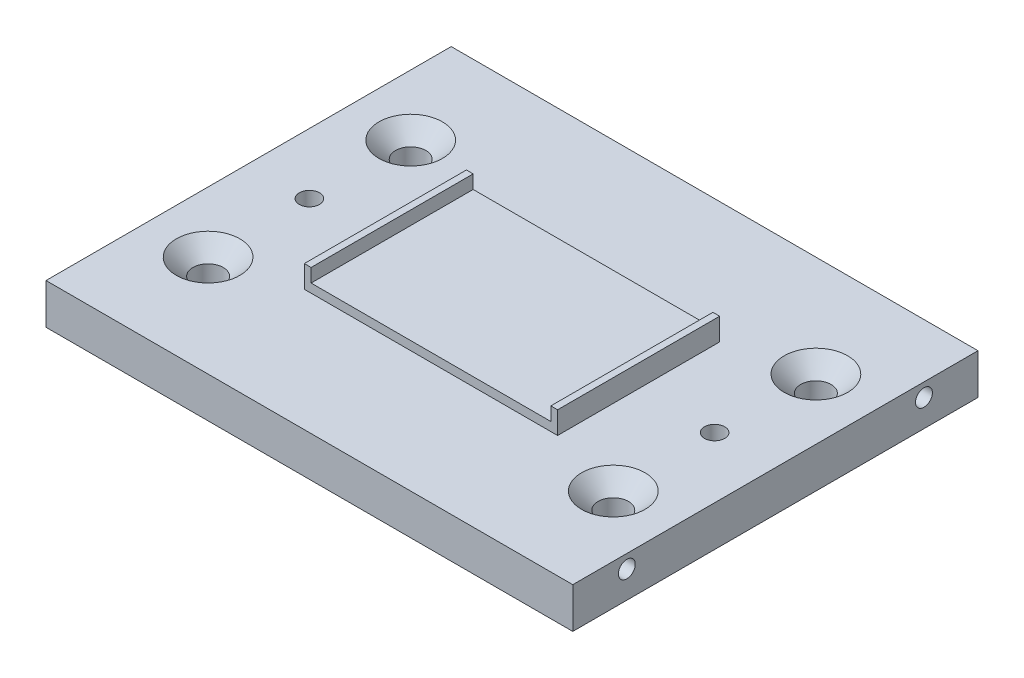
ISO-10303-21;
HEADER;
FILE_DESCRIPTION(('STEP AP214'),'2;1');
FILE_NAME('part.step','',(''),(''),'','','');
FILE_SCHEMA(('AUTOMOTIVE_DESIGN { 1 0 10303 214 1 1 1 1 }'));
ENDSEC;
DATA;
#1=APPLICATION_CONTEXT('core data for automotive mechanical design processes');
#2=APPLICATION_PROTOCOL_DEFINITION('international standard','automotive_design',2000,#1);
#3=PRODUCT_CONTEXT('',#1,'mechanical');
#4=PRODUCT('Part','Part','',(#3));
#5=PRODUCT_RELATED_PRODUCT_CATEGORY('part','',(#4));
#6=PRODUCT_DEFINITION_FORMATION('','',#4);
#7=PRODUCT_DEFINITION_CONTEXT('part definition',#1,'design');
#8=PRODUCT_DEFINITION('design','',#6,#7);
#9=PRODUCT_DEFINITION_SHAPE('','',#8);
#10=(LENGTH_UNIT() NAMED_UNIT(*) SI_UNIT(.MILLI.,.METRE.));
#11=(NAMED_UNIT(*) PLANE_ANGLE_UNIT() SI_UNIT($,.RADIAN.));
#12=(NAMED_UNIT(*) SI_UNIT($,.STERADIAN.) SOLID_ANGLE_UNIT());
#13=UNCERTAINTY_MEASURE_WITH_UNIT(LENGTH_MEASURE(1.E-05),#10,'distance_accuracy_value','');
#14=(GEOMETRIC_REPRESENTATION_CONTEXT(3) GLOBAL_UNCERTAINTY_ASSIGNED_CONTEXT((#13)) GLOBAL_UNIT_ASSIGNED_CONTEXT((#10,
#11,#12)) REPRESENTATION_CONTEXT('',''));
#15=CARTESIAN_POINT('',(0.,0.,0.));
#16=DIRECTION('',(0.,0.,1.));
#17=DIRECTION('',(1.,0.,0.));
#18=AXIS2_PLACEMENT_3D('',#15,#16,#17);
#19=CARTESIAN_POINT('',(0.,4.3,0.));
#20=DIRECTION('',(0.,-1.,0.));
#21=DIRECTION('',(0.,0.,-1.));
#22=AXIS2_PLACEMENT_3D('',#19,#20,#21);
#23=PLANE('',#22);
#24=DIRECTION('',(0.,0.,1.));
#25=VECTOR('',#24,1.);
#26=CARTESIAN_POINT('',(17.75,4.3,12.));
#27=LINE('',#26,#25);
#28=CARTESIAN_POINT('',(17.75,4.3,-12.));
#29=VERTEX_POINT('',#28);
#30=CARTESIAN_POINT('',(17.75,4.3,12.));
#31=VERTEX_POINT('',#30);
#32=EDGE_CURVE('E54',#29,#31,#27,.T.);
#33=ORIENTED_EDGE('',*,*,#32,.F.);
#34=DIRECTION('',(-1.,0.,0.));
#35=VECTOR('',#34,1.);
#36=CARTESIAN_POINT('',(-18.75,4.3,-12.));
#37=LINE('',#36,#35);
#38=CARTESIAN_POINT('',(-17.75,4.3,-12.));
#39=VERTEX_POINT('',#38);
#40=EDGE_CURVE('E40',#29,#39,#37,.T.);
#41=ORIENTED_EDGE('',*,*,#40,.T.);
#42=DIRECTION('',(0.,0.,-1.));
#43=VECTOR('',#42,1.);
#44=CARTESIAN_POINT('',(-17.75,4.3,12.));
#45=LINE('',#44,#43);
#46=CARTESIAN_POINT('',(-17.75,4.3,12.));
#47=VERTEX_POINT('',#46);
#48=EDGE_CURVE('E234',#47,#39,#45,.T.);
#49=ORIENTED_EDGE('',*,*,#48,.F.);
#50=DIRECTION('',(1.,0.,0.));
#51=VECTOR('',#50,1.);
#52=CARTESIAN_POINT('',(-18.75,4.3,12.));
#53=LINE('',#52,#51);
#54=EDGE_CURVE('E59',#47,#31,#53,.T.);
#55=ORIENTED_EDGE('',*,*,#54,.T.);
#56=EDGE_LOOP('',(#33,#41,#49,#55));
#57=FACE_BOUND('',#56,.T.);
#58=ADVANCED_FACE('F36',(#57),#23,.F.);
#59=CARTESIAN_POINT('',(39.,3.,30.));
#60=DIRECTION('',(0.,-1.,0.));
#61=DIRECTION('',(0.,0.,-1.));
#62=AXIS2_PLACEMENT_3D('',#59,#60,#61);
#63=PLANE('',#62);
#64=CARTESIAN_POINT('',(-30.,3.,0.));
#65=DIRECTION('',(0.,1.,0.));
#66=DIRECTION('',(0.,0.,1.));
#67=AXIS2_PLACEMENT_3D('',#64,#65,#66);
#68=CIRCLE('',#67,1.49999999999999);
#69=CARTESIAN_POINT('',(-30.,3.,1.49999999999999));
#70=VERTEX_POINT('',#69);
#71=EDGE_CURVE('E169',#70,#70,#68,.T.);
#72=ORIENTED_EDGE('',*,*,#71,.F.);
#73=EDGE_LOOP('',(#72));
#74=FACE_BOUND('',#73,.T.);
#75=CARTESIAN_POINT('',(30.,3.,0.));
#76=DIRECTION('',(0.,1.,0.));
#77=DIRECTION('',(0.,0.,1.));
#78=AXIS2_PLACEMENT_3D('',#75,#76,#77);
#79=CIRCLE('',#78,1.49999999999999);
#80=CARTESIAN_POINT('',(30.,3.,1.49999999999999));
#81=VERTEX_POINT('',#80);
#82=EDGE_CURVE('E175',#81,#81,#79,.T.);
#83=ORIENTED_EDGE('',*,*,#82,.F.);
#84=EDGE_LOOP('',(#83));
#85=FACE_BOUND('',#84,.T.);
#86=CARTESIAN_POINT('',(-30.,3.,-15.));
#87=DIRECTION('',(0.,1.,0.));
#88=DIRECTION('',(0.,0.,1.));
#89=AXIS2_PLACEMENT_3D('',#86,#87,#88);
#90=CIRCLE('',#89,4.7);
#91=CARTESIAN_POINT('',(-30.,3.,-10.3));
#92=VERTEX_POINT('',#91);
#93=EDGE_CURVE('E181',#92,#92,#90,.T.);
#94=ORIENTED_EDGE('',*,*,#93,.F.);
#95=EDGE_LOOP('',(#94));
#96=FACE_BOUND('',#95,.T.);
#97=CARTESIAN_POINT('',(30.,3.,-15.));
#98=DIRECTION('',(0.,1.,0.));
#99=DIRECTION('',(0.,0.,1.));
#100=AXIS2_PLACEMENT_3D('',#97,#98,#99);
#101=CIRCLE('',#100,4.7);
#102=CARTESIAN_POINT('',(30.,3.,-10.3));
#103=VERTEX_POINT('',#102);
#104=EDGE_CURVE('E190',#103,#103,#101,.T.);
#105=ORIENTED_EDGE('',*,*,#104,.F.);
#106=EDGE_LOOP('',(#105));
#107=FACE_BOUND('',#106,.T.);
#108=CARTESIAN_POINT('',(30.,3.,15.));
#109=DIRECTION('',(0.,1.,0.));
#110=DIRECTION('',(0.,0.,1.));
#111=AXIS2_PLACEMENT_3D('',#108,#109,#110);
#112=CIRCLE('',#111,4.7);
#113=CARTESIAN_POINT('',(30.,3.,19.7));
#114=VERTEX_POINT('',#113);
#115=EDGE_CURVE('E199',#114,#114,#112,.T.);
#116=ORIENTED_EDGE('',*,*,#115,.F.);
#117=EDGE_LOOP('',(#116));
#118=FACE_BOUND('',#117,.T.);
#119=CARTESIAN_POINT('',(-30.,3.,15.));
#120=DIRECTION('',(0.,1.,0.));
#121=DIRECTION('',(0.,0.,1.));
#122=AXIS2_PLACEMENT_3D('',#119,#120,#121);
#123=CIRCLE('',#122,4.7);
#124=CARTESIAN_POINT('',(-30.,3.,19.7));
#125=VERTEX_POINT('',#124);
#126=EDGE_CURVE('E208',#125,#125,#123,.T.);
#127=ORIENTED_EDGE('',*,*,#126,.F.);
#128=EDGE_LOOP('',(#127));
#129=FACE_BOUND('',#128,.T.);
#130=DIRECTION('',(0.,0.,1.));
#131=VECTOR('',#130,1.);
#132=CARTESIAN_POINT('',(-39.,3.,30.));
#133=LINE('',#132,#131);
#134=CARTESIAN_POINT('',(-39.,3.,-30.));
#135=VERTEX_POINT('',#134);
#136=CARTESIAN_POINT('',(-39.,3.,30.));
#137=VERTEX_POINT('',#136);
#138=EDGE_CURVE('E304',#135,#137,#133,.T.);
#139=ORIENTED_EDGE('',*,*,#138,.T.);
#140=DIRECTION('',(-1.,0.,0.));
#141=VECTOR('',#140,1.);
#142=CARTESIAN_POINT('',(39.,3.,30.));
#143=LINE('',#142,#141);
#144=CARTESIAN_POINT('',(39.,3.,30.));
#145=VERTEX_POINT('',#144);
#146=EDGE_CURVE('E46',#145,#137,#143,.T.);
#147=ORIENTED_EDGE('',*,*,#146,.F.);
#148=DIRECTION('',(0.,0.,1.));
#149=VECTOR('',#148,1.);
#150=CARTESIAN_POINT('',(39.,3.,30.));
#151=LINE('',#150,#149);
#152=CARTESIAN_POINT('',(39.,3.,-30.));
#153=VERTEX_POINT('',#152);
#154=EDGE_CURVE('E294',#153,#145,#151,.T.);
#155=ORIENTED_EDGE('',*,*,#154,.F.);
#156=DIRECTION('',(-1.,0.,0.));
#157=VECTOR('',#156,1.);
#158=CARTESIAN_POINT('',(39.,3.,-30.));
#159=LINE('',#158,#157);
#160=EDGE_CURVE('E11',#153,#135,#159,.T.);
#161=ORIENTED_EDGE('',*,*,#160,.T.);
#162=EDGE_LOOP('',(#139,#147,#155,#161));
#163=FACE_BOUND('',#162,.T.);
#164=DIRECTION('',(0.,0.,-1.));
#165=VECTOR('',#164,1.);
#166=CARTESIAN_POINT('',(18.75,3.,12.));
#167=LINE('',#166,#165);
#168=CARTESIAN_POINT('',(18.75,3.,12.));
#169=VERTEX_POINT('',#168);
#170=CARTESIAN_POINT('',(18.75,3.,-12.));
#171=VERTEX_POINT('',#170);
#172=EDGE_CURVE('E259',#169,#171,#167,.T.);
#173=ORIENTED_EDGE('',*,*,#172,.F.);
#174=DIRECTION('',(1.,0.,0.));
#175=VECTOR('',#174,1.);
#176=CARTESIAN_POINT('',(-18.75,3.,12.));
#177=LINE('',#176,#175);
#178=CARTESIAN_POINT('',(-18.75,3.,12.));
#179=VERTEX_POINT('',#178);
#180=EDGE_CURVE('E276',#179,#169,#177,.T.);
#181=ORIENTED_EDGE('',*,*,#180,.F.);
#182=DIRECTION('',(0.,0.,1.));
#183=VECTOR('',#182,1.);
#184=CARTESIAN_POINT('',(-18.75,3.,12.));
#185=LINE('',#184,#183);
#186=CARTESIAN_POINT('',(-18.75,3.,-12.));
#187=VERTEX_POINT('',#186);
#188=EDGE_CURVE('E270',#187,#179,#185,.T.);
#189=ORIENTED_EDGE('',*,*,#188,.F.);
#190=DIRECTION('',(-1.,0.,0.));
#191=VECTOR('',#190,1.);
#192=CARTESIAN_POINT('',(-18.75,3.,-12.));
#193=LINE('',#192,#191);
#194=EDGE_CURVE('E265',#171,#187,#193,.T.);
#195=ORIENTED_EDGE('',*,*,#194,.F.);
#196=EDGE_LOOP('',(#173,#181,#189,#195));
#197=FACE_BOUND('',#196,.T.);
#198=ADVANCED_FACE('F335',(#74,#85,#96,#107,#118,#129,#163,#197),#63,.F.);
#199=CARTESIAN_POINT('',(39.,-3.,-30.));
#200=DIRECTION('',(0.,0.,1.));
#201=DIRECTION('',(1.,0.,0.));
#202=AXIS2_PLACEMENT_3D('',#199,#200,#201);
#203=PLANE('',#202);
#204=DIRECTION('',(0.,1.,0.));
#205=VECTOR('',#204,1.);
#206=CARTESIAN_POINT('',(-39.,-3.,-30.));
#207=LINE('',#206,#205);
#208=CARTESIAN_POINT('',(-39.,-3.,-30.));
#209=VERTEX_POINT('',#208);
#210=EDGE_CURVE('E290',#209,#135,#207,.T.);
#211=ORIENTED_EDGE('',*,*,#210,.T.);
#212=ORIENTED_EDGE('',*,*,#160,.F.);
#213=DIRECTION('',(0.,1.,0.));
#214=VECTOR('',#213,1.);
#215=CARTESIAN_POINT('',(39.,-3.,-30.));
#216=LINE('',#215,#214);
#217=CARTESIAN_POINT('',(39.,-3.,-30.));
#218=VERTEX_POINT('',#217);
#219=EDGE_CURVE('E291',#218,#153,#216,.T.);
#220=ORIENTED_EDGE('',*,*,#219,.F.);
#221=DIRECTION('',(-1.,0.,0.));
#222=VECTOR('',#221,1.);
#223=CARTESIAN_POINT('',(39.,-3.,-30.));
#224=LINE('',#223,#222);
#225=EDGE_CURVE('E301',#218,#209,#224,.T.);
#226=ORIENTED_EDGE('',*,*,#225,.T.);
#227=EDGE_LOOP('',(#211,#212,#220,#226));
#228=FACE_BOUND('',#227,.T.);
#229=ADVANCED_FACE('F38',(#228),#203,.F.);
#230=CARTESIAN_POINT('',(39.,-3.,30.));
#231=DIRECTION('',(0.,0.,-1.));
#232=DIRECTION('',(-1.,0.,0.));
#233=AXIS2_PLACEMENT_3D('',#230,#231,#232);
#234=PLANE('',#233);
#235=DIRECTION('',(0.,-1.,0.));
#236=VECTOR('',#235,1.);
#237=CARTESIAN_POINT('',(-39.,-3.,30.));
#238=LINE('',#237,#236);
#239=CARTESIAN_POINT('',(-39.,-3.,30.));
#240=VERTEX_POINT('',#239);
#241=EDGE_CURVE('E306',#137,#240,#238,.T.);
#242=ORIENTED_EDGE('',*,*,#241,.T.);
#243=DIRECTION('',(-1.,0.,0.));
#244=VECTOR('',#243,1.);
#245=CARTESIAN_POINT('',(39.,-3.,30.));
#246=LINE('',#245,#244);
#247=CARTESIAN_POINT('',(39.,-3.,30.));
#248=VERTEX_POINT('',#247);
#249=EDGE_CURVE('E311',#248,#240,#246,.T.);
#250=ORIENTED_EDGE('',*,*,#249,.F.);
#251=DIRECTION('',(0.,-1.,0.));
#252=VECTOR('',#251,1.);
#253=CARTESIAN_POINT('',(39.,-3.,30.));
#254=LINE('',#253,#252);
#255=EDGE_CURVE('E297',#145,#248,#254,.T.);
#256=ORIENTED_EDGE('',*,*,#255,.F.);
#257=ORIENTED_EDGE('',*,*,#146,.T.);
#258=EDGE_LOOP('',(#242,#250,#256,#257));
#259=FACE_BOUND('',#258,.T.);
#260=ADVANCED_FACE('F319',(#259),#234,.F.);
#261=CARTESIAN_POINT('',(39.,-3.,30.));
#262=DIRECTION('',(0.,1.,0.));
#263=DIRECTION('',(0.,0.,1.));
#264=AXIS2_PLACEMENT_3D('',#261,#262,#263);
#265=PLANE('',#264);
#266=CARTESIAN_POINT('',(-30.,-3.,0.));
#267=DIRECTION('',(0.,1.,0.));
#268=DIRECTION('',(0.,0.,1.));
#269=AXIS2_PLACEMENT_3D('',#266,#267,#268);
#270=CIRCLE('',#269,1.5);
#271=CARTESIAN_POINT('',(-30.,-3.,1.5));
#272=VERTEX_POINT('',#271);
#273=EDGE_CURVE('E172',#272,#272,#270,.T.);
#274=ORIENTED_EDGE('',*,*,#273,.T.);
#275=EDGE_LOOP('',(#274));
#276=FACE_BOUND('',#275,.T.);
#277=CARTESIAN_POINT('',(30.,-3.,0.));
#278=DIRECTION('',(0.,1.,0.));
#279=DIRECTION('',(0.,0.,1.));
#280=AXIS2_PLACEMENT_3D('',#277,#278,#279);
#281=CIRCLE('',#280,1.5);
#282=CARTESIAN_POINT('',(30.,-3.,1.5));
#283=VERTEX_POINT('',#282);
#284=EDGE_CURVE('E178',#283,#283,#281,.T.);
#285=ORIENTED_EDGE('',*,*,#284,.T.);
#286=EDGE_LOOP('',(#285));
#287=FACE_BOUND('',#286,.T.);
#288=CARTESIAN_POINT('',(-30.,-3.,-15.));
#289=DIRECTION('',(0.,1.,0.));
#290=DIRECTION('',(0.,0.,1.));
#291=AXIS2_PLACEMENT_3D('',#288,#289,#290);
#292=CIRCLE('',#291,2.25);
#293=CARTESIAN_POINT('',(-30.,-3.,-12.75));
#294=VERTEX_POINT('',#293);
#295=EDGE_CURVE('E187',#294,#294,#292,.T.);
#296=ORIENTED_EDGE('',*,*,#295,.T.);
#297=EDGE_LOOP('',(#296));
#298=FACE_BOUND('',#297,.T.);
#299=CARTESIAN_POINT('',(30.,-3.,-15.));
#300=DIRECTION('',(0.,1.,0.));
#301=DIRECTION('',(0.,0.,1.));
#302=AXIS2_PLACEMENT_3D('',#299,#300,#301);
#303=CIRCLE('',#302,2.25);
#304=CARTESIAN_POINT('',(30.,-3.,-12.75));
#305=VERTEX_POINT('',#304);
#306=EDGE_CURVE('E196',#305,#305,#303,.T.);
#307=ORIENTED_EDGE('',*,*,#306,.T.);
#308=EDGE_LOOP('',(#307));
#309=FACE_BOUND('',#308,.T.);
#310=CARTESIAN_POINT('',(30.,-3.,15.));
#311=DIRECTION('',(0.,1.,0.));
#312=DIRECTION('',(0.,0.,1.));
#313=AXIS2_PLACEMENT_3D('',#310,#311,#312);
#314=CIRCLE('',#313,2.25);
#315=CARTESIAN_POINT('',(30.,-3.,17.25));
#316=VERTEX_POINT('',#315);
#317=EDGE_CURVE('E205',#316,#316,#314,.T.);
#318=ORIENTED_EDGE('',*,*,#317,.T.);
#319=EDGE_LOOP('',(#318));
#320=FACE_BOUND('',#319,.T.);
#321=CARTESIAN_POINT('',(-30.,-3.,15.));
#322=DIRECTION('',(0.,1.,0.));
#323=DIRECTION('',(0.,0.,1.));
#324=AXIS2_PLACEMENT_3D('',#321,#322,#323);
#325=CIRCLE('',#324,2.25);
#326=CARTESIAN_POINT('',(-30.,-3.,17.25));
#327=VERTEX_POINT('',#326);
#328=EDGE_CURVE('E214',#327,#327,#325,.T.);
#329=ORIENTED_EDGE('',*,*,#328,.T.);
#330=EDGE_LOOP('',(#329));
#331=FACE_BOUND('',#330,.T.);
#332=DIRECTION('',(0.,0.,-1.));
#333=VECTOR('',#332,1.);
#334=CARTESIAN_POINT('',(-39.,-3.,30.));
#335=LINE('',#334,#333);
#336=EDGE_CURVE('E295',#240,#209,#335,.T.);
#337=ORIENTED_EDGE('',*,*,#336,.T.);
#338=ORIENTED_EDGE('',*,*,#225,.F.);
#339=DIRECTION('',(0.,0.,-1.));
#340=VECTOR('',#339,1.);
#341=CARTESIAN_POINT('',(39.,-3.,30.));
#342=LINE('',#341,#340);
#343=EDGE_CURVE('E299',#248,#218,#342,.T.);
#344=ORIENTED_EDGE('',*,*,#343,.F.);
#345=ORIENTED_EDGE('',*,*,#249,.T.);
#346=EDGE_LOOP('',(#337,#338,#344,#345));
#347=FACE_BOUND('',#346,.T.);
#348=ADVANCED_FACE('F328',(#276,#287,#298,#309,#320,#331,#347),#265,.F.);
#349=CARTESIAN_POINT('',(39.,0.,0.));
#350=DIRECTION('',(-1.,0.,0.));
#351=DIRECTION('',(0.,0.,1.));
#352=AXIS2_PLACEMENT_3D('',#349,#350,#351);
#353=PLANE('',#352);
#354=CARTESIAN_POINT('',(39.,1.,-22.));
#355=DIRECTION('',(1.,0.,0.));
#356=DIRECTION('',(0.,0.,-1.));
#357=AXIS2_PLACEMENT_3D('',#354,#355,#356);
#358=CIRCLE('',#357,1.24999999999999);
#359=CARTESIAN_POINT('',(39.,1.,-23.25));
#360=VERTEX_POINT('',#359);
#361=EDGE_CURVE('E147',#360,#360,#358,.T.);
#362=ORIENTED_EDGE('',*,*,#361,.F.);
#363=EDGE_LOOP('',(#362));
#364=FACE_BOUND('',#363,.T.);
#365=CARTESIAN_POINT('',(39.,1.,22.));
#366=DIRECTION('',(1.,0.,0.));
#367=DIRECTION('',(0.,0.,-1.));
#368=AXIS2_PLACEMENT_3D('',#365,#366,#367);
#369=CIRCLE('',#368,1.24999999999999);
#370=CARTESIAN_POINT('',(39.,1.,20.75));
#371=VERTEX_POINT('',#370);
#372=EDGE_CURVE('E146',#371,#371,#369,.T.);
#373=ORIENTED_EDGE('',*,*,#372,.F.);
#374=EDGE_LOOP('',(#373));
#375=FACE_BOUND('',#374,.T.);
#376=ORIENTED_EDGE('',*,*,#219,.T.);
#377=ORIENTED_EDGE('',*,*,#154,.T.);
#378=ORIENTED_EDGE('',*,*,#255,.T.);
#379=ORIENTED_EDGE('',*,*,#343,.T.);
#380=EDGE_LOOP('',(#376,#377,#378,#379));
#381=FACE_BOUND('',#380,.T.);
#382=ADVANCED_FACE('F334',(#364,#375,#381),#353,.F.);
#383=CARTESIAN_POINT('',(-39.,0.,0.));
#384=DIRECTION('',(-1.,0.,0.));
#385=DIRECTION('',(0.,0.,1.));
#386=AXIS2_PLACEMENT_3D('',#383,#384,#385);
#387=PLANE('',#386);
#388=CARTESIAN_POINT('',(-39.,1.,-22.));
#389=DIRECTION('',(-1.,0.,0.));
#390=DIRECTION('',(0.,0.,1.));
#391=AXIS2_PLACEMENT_3D('',#388,#389,#390);
#392=CIRCLE('',#391,1.24999999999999);
#393=CARTESIAN_POINT('',(-39.,1.,-20.75));
#394=VERTEX_POINT('',#393);
#395=EDGE_CURVE('E157',#394,#394,#392,.T.);
#396=ORIENTED_EDGE('',*,*,#395,.F.);
#397=EDGE_LOOP('',(#396));
#398=FACE_BOUND('',#397,.T.);
#399=CARTESIAN_POINT('',(-39.,1.,22.));
#400=DIRECTION('',(-1.,0.,0.));
#401=DIRECTION('',(0.,0.,1.));
#402=AXIS2_PLACEMENT_3D('',#399,#400,#401);
#403=CIRCLE('',#402,1.24999999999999);
#404=CARTESIAN_POINT('',(-39.,1.,23.25));
#405=VERTEX_POINT('',#404);
#406=EDGE_CURVE('E163',#405,#405,#403,.T.);
#407=ORIENTED_EDGE('',*,*,#406,.F.);
#408=EDGE_LOOP('',(#407));
#409=FACE_BOUND('',#408,.T.);
#410=ORIENTED_EDGE('',*,*,#210,.F.);
#411=ORIENTED_EDGE('',*,*,#336,.F.);
#412=ORIENTED_EDGE('',*,*,#241,.F.);
#413=ORIENTED_EDGE('',*,*,#138,.F.);
#414=EDGE_LOOP('',(#410,#411,#412,#413));
#415=FACE_BOUND('',#414,.T.);
#416=ADVANCED_FACE('F325',(#398,#409,#415),#387,.T.);
#417=CARTESIAN_POINT('',(18.75,4.3,12.));
#418=DIRECTION('',(-1.,0.,0.));
#419=DIRECTION('',(0.,0.,1.));
#420=AXIS2_PLACEMENT_3D('',#417,#418,#419);
#421=PLANE('',#420);
#422=ORIENTED_EDGE('',*,*,#172,.T.);
#423=DIRECTION('',(0.,-1.,0.));
#424=VECTOR('',#423,1.);
#425=CARTESIAN_POINT('',(18.75,4.3,-12.));
#426=LINE('',#425,#424);
#427=CARTESIAN_POINT('',(18.75,6.3,-12.));
#428=VERTEX_POINT('',#427);
#429=EDGE_CURVE('E287',#428,#171,#426,.T.);
#430=ORIENTED_EDGE('',*,*,#429,.F.);
#431=DIRECTION('',(0.,0.,-1.));
#432=VECTOR('',#431,1.);
#433=CARTESIAN_POINT('',(18.75,6.3,12.));
#434=LINE('',#433,#432);
#435=CARTESIAN_POINT('',(18.75,6.3,12.));
#436=VERTEX_POINT('',#435);
#437=EDGE_CURVE('E217',#436,#428,#434,.T.);
#438=ORIENTED_EDGE('',*,*,#437,.F.);
#439=DIRECTION('',(0.,-1.,0.));
#440=VECTOR('',#439,1.);
#441=CARTESIAN_POINT('',(18.75,4.3,12.));
#442=LINE('',#441,#440);
#443=EDGE_CURVE('E279',#436,#169,#442,.T.);
#444=ORIENTED_EDGE('',*,*,#443,.T.);
#445=EDGE_LOOP('',(#422,#430,#438,#444));
#446=FACE_BOUND('',#445,.T.);
#447=ADVANCED_FACE('F344',(#446),#421,.F.);
#448=CARTESIAN_POINT('',(-18.75,4.3,-12.));
#449=DIRECTION('',(0.,0.,1.));
#450=DIRECTION('',(1.,0.,0.));
#451=AXIS2_PLACEMENT_3D('',#448,#449,#450);
#452=PLANE('',#451);
#453=ORIENTED_EDGE('',*,*,#194,.T.);
#454=DIRECTION('',(0.,-1.,0.));
#455=VECTOR('',#454,1.);
#456=CARTESIAN_POINT('',(-18.75,4.3,-12.));
#457=LINE('',#456,#455);
#458=CARTESIAN_POINT('',(-18.75,6.3,-12.));
#459=VERTEX_POINT('',#458);
#460=EDGE_CURVE('E284',#459,#187,#457,.T.);
#461=ORIENTED_EDGE('',*,*,#460,.F.);
#462=DIRECTION('',(-1.,0.,0.));
#463=VECTOR('',#462,1.);
#464=CARTESIAN_POINT('',(-18.75,6.3,-12.));
#465=LINE('',#464,#463);
#466=CARTESIAN_POINT('',(-17.75,6.3,-12.));
#467=VERTEX_POINT('',#466);
#468=EDGE_CURVE('E242',#467,#459,#465,.T.);
#469=ORIENTED_EDGE('',*,*,#468,.F.);
#470=DIRECTION('',(0.,-1.,0.));
#471=VECTOR('',#470,1.);
#472=CARTESIAN_POINT('',(-17.75,6.3,-12.));
#473=LINE('',#472,#471);
#474=EDGE_CURVE('E245',#467,#39,#473,.T.);
#475=ORIENTED_EDGE('',*,*,#474,.T.);
#476=ORIENTED_EDGE('',*,*,#40,.F.);
#477=DIRECTION('',(0.,-1.,0.));
#478=VECTOR('',#477,1.);
#479=CARTESIAN_POINT('',(17.75,6.3,-12.));
#480=LINE('',#479,#478);
#481=CARTESIAN_POINT('',(17.75,6.3,-12.));
#482=VERTEX_POINT('',#481);
#483=EDGE_CURVE('E231',#482,#29,#480,.T.);
#484=ORIENTED_EDGE('',*,*,#483,.F.);
#485=DIRECTION('',(-1.,0.,0.));
#486=VECTOR('',#485,1.);
#487=CARTESIAN_POINT('',(18.75,6.3,-12.));
#488=LINE('',#487,#486);
#489=EDGE_CURVE('E220',#428,#482,#488,.T.);
#490=ORIENTED_EDGE('',*,*,#489,.F.);
#491=ORIENTED_EDGE('',*,*,#429,.T.);
#492=EDGE_LOOP('',(#453,#461,#469,#475,#476,#484,#490,#491));
#493=FACE_BOUND('',#492,.T.);
#494=ADVANCED_FACE('F354',(#493),#452,.F.);
#495=CARTESIAN_POINT('',(-18.75,4.3,12.));
#496=DIRECTION('',(1.,0.,0.));
#497=DIRECTION('',(0.,0.,-1.));
#498=AXIS2_PLACEMENT_3D('',#495,#496,#497);
#499=PLANE('',#498);
#500=ORIENTED_EDGE('',*,*,#188,.T.);
#501=DIRECTION('',(0.,-1.,0.));
#502=VECTOR('',#501,1.);
#503=CARTESIAN_POINT('',(-18.75,4.3,12.));
#504=LINE('',#503,#502);
#505=CARTESIAN_POINT('',(-18.75,6.3,12.));
#506=VERTEX_POINT('',#505);
#507=EDGE_CURVE('E281',#506,#179,#504,.T.);
#508=ORIENTED_EDGE('',*,*,#507,.F.);
#509=DIRECTION('',(0.,0.,1.));
#510=VECTOR('',#509,1.);
#511=CARTESIAN_POINT('',(-18.75,6.3,12.));
#512=LINE('',#511,#510);
#513=EDGE_CURVE('E235',#459,#506,#512,.T.);
#514=ORIENTED_EDGE('',*,*,#513,.F.);
#515=ORIENTED_EDGE('',*,*,#460,.T.);
#516=EDGE_LOOP('',(#500,#508,#514,#515));
#517=FACE_BOUND('',#516,.T.);
#518=ADVANCED_FACE('F362',(#517),#499,.F.);
#519=CARTESIAN_POINT('',(-18.75,4.3,12.));
#520=DIRECTION('',(0.,0.,-1.));
#521=DIRECTION('',(-1.,0.,0.));
#522=AXIS2_PLACEMENT_3D('',#519,#520,#521);
#523=PLANE('',#522);
#524=ORIENTED_EDGE('',*,*,#180,.T.);
#525=ORIENTED_EDGE('',*,*,#443,.F.);
#526=DIRECTION('',(1.,0.,0.));
#527=VECTOR('',#526,1.);
#528=CARTESIAN_POINT('',(18.75,6.3,12.));
#529=LINE('',#528,#527);
#530=CARTESIAN_POINT('',(17.75,6.3,12.));
#531=VERTEX_POINT('',#530);
#532=EDGE_CURVE('E224',#531,#436,#529,.T.);
#533=ORIENTED_EDGE('',*,*,#532,.F.);
#534=DIRECTION('',(0.,-1.,0.));
#535=VECTOR('',#534,1.);
#536=CARTESIAN_POINT('',(17.75,6.3,12.));
#537=LINE('',#536,#535);
#538=EDGE_CURVE('E227',#531,#31,#537,.T.);
#539=ORIENTED_EDGE('',*,*,#538,.T.);
#540=ORIENTED_EDGE('',*,*,#54,.F.);
#541=DIRECTION('',(0.,-1.,0.));
#542=VECTOR('',#541,1.);
#543=CARTESIAN_POINT('',(-17.75,6.3,12.));
#544=LINE('',#543,#542);
#545=CARTESIAN_POINT('',(-17.75,6.3,12.));
#546=VERTEX_POINT('',#545);
#547=EDGE_CURVE('E255',#546,#47,#544,.T.);
#548=ORIENTED_EDGE('',*,*,#547,.F.);
#549=DIRECTION('',(1.,0.,0.));
#550=VECTOR('',#549,1.);
#551=CARTESIAN_POINT('',(-18.75,6.3,12.));
#552=LINE('',#551,#550);
#553=EDGE_CURVE('E238',#506,#546,#552,.T.);
#554=ORIENTED_EDGE('',*,*,#553,.F.);
#555=ORIENTED_EDGE('',*,*,#507,.T.);
#556=EDGE_LOOP('',(#524,#525,#533,#539,#540,#548,#554,#555));
#557=FACE_BOUND('',#556,.T.);
#558=ADVANCED_FACE('F340',(#557),#523,.F.);
#559=CARTESIAN_POINT('',(-17.75,6.3,12.));
#560=DIRECTION('',(-1.,0.,0.));
#561=DIRECTION('',(0.,0.,1.));
#562=AXIS2_PLACEMENT_3D('',#559,#560,#561);
#563=PLANE('',#562);
#564=ORIENTED_EDGE('',*,*,#48,.T.);
#565=ORIENTED_EDGE('',*,*,#474,.F.);
#566=DIRECTION('',(0.,0.,-1.));
#567=VECTOR('',#566,1.);
#568=CARTESIAN_POINT('',(-17.75,6.3,12.));
#569=LINE('',#568,#567);
#570=EDGE_CURVE('E240',#546,#467,#569,.T.);
#571=ORIENTED_EDGE('',*,*,#570,.F.);
#572=ORIENTED_EDGE('',*,*,#547,.T.);
#573=EDGE_LOOP('',(#564,#565,#571,#572));
#574=FACE_BOUND('',#573,.T.);
#575=ADVANCED_FACE('F357',(#574),#563,.F.);
#576=CARTESIAN_POINT('',(0.,6.3,0.));
#577=DIRECTION('',(0.,-1.,0.));
#578=DIRECTION('',(0.,0.,-1.));
#579=AXIS2_PLACEMENT_3D('',#576,#577,#578);
#580=PLANE('',#579);
#581=ORIENTED_EDGE('',*,*,#513,.T.);
#582=ORIENTED_EDGE('',*,*,#553,.T.);
#583=ORIENTED_EDGE('',*,*,#570,.T.);
#584=ORIENTED_EDGE('',*,*,#468,.T.);
#585=EDGE_LOOP('',(#581,#582,#583,#584));
#586=FACE_BOUND('',#585,.T.);
#587=ADVANCED_FACE('F360',(#586),#580,.F.);
#588=CARTESIAN_POINT('',(17.75,6.3,12.));
#589=DIRECTION('',(1.,0.,0.));
#590=DIRECTION('',(0.,0.,-1.));
#591=AXIS2_PLACEMENT_3D('',#588,#589,#590);
#592=PLANE('',#591);
#593=ORIENTED_EDGE('',*,*,#32,.T.);
#594=ORIENTED_EDGE('',*,*,#538,.F.);
#595=DIRECTION('',(0.,0.,1.));
#596=VECTOR('',#595,1.);
#597=CARTESIAN_POINT('',(17.75,6.3,12.));
#598=LINE('',#597,#596);
#599=EDGE_CURVE('E222',#482,#531,#598,.T.);
#600=ORIENTED_EDGE('',*,*,#599,.F.);
#601=ORIENTED_EDGE('',*,*,#483,.T.);
#602=EDGE_LOOP('',(#593,#594,#600,#601));
#603=FACE_BOUND('',#602,.T.);
#604=ADVANCED_FACE('F352',(#603),#592,.F.);
#605=CARTESIAN_POINT('',(0.,6.3,0.));
#606=DIRECTION('',(0.,1.,0.));
#607=DIRECTION('',(0.,0.,1.));
#608=AXIS2_PLACEMENT_3D('',#605,#606,#607);
#609=PLANE('',#608);
#610=ORIENTED_EDGE('',*,*,#437,.T.);
#611=ORIENTED_EDGE('',*,*,#489,.T.);
#612=ORIENTED_EDGE('',*,*,#599,.T.);
#613=ORIENTED_EDGE('',*,*,#532,.T.);
#614=EDGE_LOOP('',(#610,#611,#612,#613));
#615=FACE_BOUND('',#614,.T.);
#616=ADVANCED_FACE('F347',(#615),#609,.T.);
#617=CARTESIAN_POINT('',(-30.,3.,15.));
#618=DIRECTION('',(0.,1.,0.));
#619=DIRECTION('',(0.,0.,1.));
#620=AXIS2_PLACEMENT_3D('',#617,#618,#619);
#621=CYLINDRICAL_SURFACE('',#620,2.25);
#622=ORIENTED_EDGE('',*,*,#328,.F.);
#623=EDGE_LOOP('',(#622));
#624=FACE_BOUND('',#623,.T.);
#625=CARTESIAN_POINT('',(-30.,0.55,15.));
#626=DIRECTION('',(0.,1.,0.));
#627=DIRECTION('',(0.,0.,1.));
#628=AXIS2_PLACEMENT_3D('',#625,#626,#627);
#629=CIRCLE('',#628,2.25);
#630=CARTESIAN_POINT('',(-30.,0.55,17.25));
#631=VERTEX_POINT('',#630);
#632=EDGE_CURVE('E211',#631,#631,#629,.T.);
#633=ORIENTED_EDGE('',*,*,#632,.T.);
#634=EDGE_LOOP('',(#633));
#635=FACE_BOUND('',#634,.T.);
#636=ADVANCED_FACE('F384',(#624,#635),#621,.F.);
#637=CARTESIAN_POINT('',(-30.,3.,15.));
#638=DIRECTION('',(0.,1.,0.));
#639=DIRECTION('',(0.,0.,1.));
#640=AXIS2_PLACEMENT_3D('',#637,#638,#639);
#641=CONICAL_SURFACE('',#640,4.7,0.785398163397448);
#642=ORIENTED_EDGE('',*,*,#632,.F.);
#643=EDGE_LOOP('',(#642));
#644=FACE_BOUND('',#643,.T.);
#645=ORIENTED_EDGE('',*,*,#126,.T.);
#646=EDGE_LOOP('',(#645));
#647=FACE_BOUND('',#646,.T.);
#648=ADVANCED_FACE('F387',(#644,#647),#641,.F.);
#649=CARTESIAN_POINT('',(30.,3.,15.));
#650=DIRECTION('',(0.,1.,0.));
#651=DIRECTION('',(0.,0.,1.));
#652=AXIS2_PLACEMENT_3D('',#649,#650,#651);
#653=CYLINDRICAL_SURFACE('',#652,2.25);
#654=ORIENTED_EDGE('',*,*,#317,.F.);
#655=EDGE_LOOP('',(#654));
#656=FACE_BOUND('',#655,.T.);
#657=CARTESIAN_POINT('',(30.,0.55,15.));
#658=DIRECTION('',(0.,1.,0.));
#659=DIRECTION('',(0.,0.,1.));
#660=AXIS2_PLACEMENT_3D('',#657,#658,#659);
#661=CIRCLE('',#660,2.25);
#662=CARTESIAN_POINT('',(30.,0.55,17.25));
#663=VERTEX_POINT('',#662);
#664=EDGE_CURVE('E202',#663,#663,#661,.T.);
#665=ORIENTED_EDGE('',*,*,#664,.T.);
#666=EDGE_LOOP('',(#665));
#667=FACE_BOUND('',#666,.T.);
#668=ADVANCED_FACE('F391',(#656,#667),#653,.F.);
#669=CARTESIAN_POINT('',(30.,3.,15.));
#670=DIRECTION('',(0.,1.,0.));
#671=DIRECTION('',(0.,0.,1.));
#672=AXIS2_PLACEMENT_3D('',#669,#670,#671);
#673=CONICAL_SURFACE('',#672,4.7,0.785398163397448);
#674=ORIENTED_EDGE('',*,*,#664,.F.);
#675=EDGE_LOOP('',(#674));
#676=FACE_BOUND('',#675,.T.);
#677=ORIENTED_EDGE('',*,*,#115,.T.);
#678=EDGE_LOOP('',(#677));
#679=FACE_BOUND('',#678,.T.);
#680=ADVANCED_FACE('F395',(#676,#679),#673,.F.);
#681=CARTESIAN_POINT('',(30.,3.,-15.));
#682=DIRECTION('',(0.,1.,0.));
#683=DIRECTION('',(0.,0.,1.));
#684=AXIS2_PLACEMENT_3D('',#681,#682,#683);
#685=CYLINDRICAL_SURFACE('',#684,2.25);
#686=ORIENTED_EDGE('',*,*,#306,.F.);
#687=EDGE_LOOP('',(#686));
#688=FACE_BOUND('',#687,.T.);
#689=CARTESIAN_POINT('',(30.,0.55,-15.));
#690=DIRECTION('',(0.,1.,0.));
#691=DIRECTION('',(0.,0.,1.));
#692=AXIS2_PLACEMENT_3D('',#689,#690,#691);
#693=CIRCLE('',#692,2.25);
#694=CARTESIAN_POINT('',(30.,0.55,-12.75));
#695=VERTEX_POINT('',#694);
#696=EDGE_CURVE('E193',#695,#695,#693,.T.);
#697=ORIENTED_EDGE('',*,*,#696,.T.);
#698=EDGE_LOOP('',(#697));
#699=FACE_BOUND('',#698,.T.);
#700=ADVANCED_FACE('F399',(#688,#699),#685,.F.);
#701=CARTESIAN_POINT('',(30.,3.,-15.));
#702=DIRECTION('',(0.,1.,0.));
#703=DIRECTION('',(0.,0.,1.));
#704=AXIS2_PLACEMENT_3D('',#701,#702,#703);
#705=CONICAL_SURFACE('',#704,4.7,0.785398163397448);
#706=ORIENTED_EDGE('',*,*,#696,.F.);
#707=EDGE_LOOP('',(#706));
#708=FACE_BOUND('',#707,.T.);
#709=ORIENTED_EDGE('',*,*,#104,.T.);
#710=EDGE_LOOP('',(#709));
#711=FACE_BOUND('',#710,.T.);
#712=ADVANCED_FACE('F403',(#708,#711),#705,.F.);
#713=CARTESIAN_POINT('',(-30.,3.,-15.));
#714=DIRECTION('',(0.,1.,0.));
#715=DIRECTION('',(0.,0.,1.));
#716=AXIS2_PLACEMENT_3D('',#713,#714,#715);
#717=CYLINDRICAL_SURFACE('',#716,2.25);
#718=ORIENTED_EDGE('',*,*,#295,.F.);
#719=EDGE_LOOP('',(#718));
#720=FACE_BOUND('',#719,.T.);
#721=CARTESIAN_POINT('',(-30.,0.55,-15.));
#722=DIRECTION('',(0.,1.,0.));
#723=DIRECTION('',(0.,0.,1.));
#724=AXIS2_PLACEMENT_3D('',#721,#722,#723);
#725=CIRCLE('',#724,2.25);
#726=CARTESIAN_POINT('',(-30.,0.55,-12.75));
#727=VERTEX_POINT('',#726);
#728=EDGE_CURVE('E184',#727,#727,#725,.T.);
#729=ORIENTED_EDGE('',*,*,#728,.T.);
#730=EDGE_LOOP('',(#729));
#731=FACE_BOUND('',#730,.T.);
#732=ADVANCED_FACE('F407',(#720,#731),#717,.F.);
#733=CARTESIAN_POINT('',(-30.,3.,-15.));
#734=DIRECTION('',(0.,1.,0.));
#735=DIRECTION('',(0.,0.,1.));
#736=AXIS2_PLACEMENT_3D('',#733,#734,#735);
#737=CONICAL_SURFACE('',#736,4.7,0.785398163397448);
#738=ORIENTED_EDGE('',*,*,#728,.F.);
#739=EDGE_LOOP('',(#738));
#740=FACE_BOUND('',#739,.T.);
#741=ORIENTED_EDGE('',*,*,#93,.T.);
#742=EDGE_LOOP('',(#741));
#743=FACE_BOUND('',#742,.T.);
#744=ADVANCED_FACE('F411',(#740,#743),#737,.F.);
#745=CARTESIAN_POINT('',(30.,3.,0.));
#746=DIRECTION('',(0.,1.,0.));
#747=DIRECTION('',(0.,0.,1.));
#748=AXIS2_PLACEMENT_3D('',#745,#746,#747);
#749=CYLINDRICAL_SURFACE('',#748,1.49999999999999);
#750=ORIENTED_EDGE('',*,*,#284,.F.);
#751=EDGE_LOOP('',(#750));
#752=FACE_BOUND('',#751,.T.);
#753=ORIENTED_EDGE('',*,*,#82,.T.);
#754=EDGE_LOOP('',(#753));
#755=FACE_BOUND('',#754,.T.);
#756=ADVANCED_FACE('F415',(#752,#755),#749,.F.);
#757=CARTESIAN_POINT('',(-30.,3.,0.));
#758=DIRECTION('',(0.,1.,0.));
#759=DIRECTION('',(0.,0.,1.));
#760=AXIS2_PLACEMENT_3D('',#757,#758,#759);
#761=CYLINDRICAL_SURFACE('',#760,1.49999999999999);
#762=ORIENTED_EDGE('',*,*,#273,.F.);
#763=EDGE_LOOP('',(#762));
#764=FACE_BOUND('',#763,.T.);
#765=ORIENTED_EDGE('',*,*,#71,.T.);
#766=EDGE_LOOP('',(#765));
#767=FACE_BOUND('',#766,.T.);
#768=ADVANCED_FACE('F419',(#764,#767),#761,.F.);
#769=CARTESIAN_POINT('',(-31.5,1.,22.));
#770=DIRECTION('',(-1.,0.,0.));
#771=DIRECTION('',(0.,0.,1.));
#772=AXIS2_PLACEMENT_3D('',#769,#770,#771);
#773=CONICAL_SURFACE('',#772,1.24999999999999,1.02974425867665);
#774=CARTESIAN_POINT('',(-30.7489242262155,0.999999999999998,22.));
#775=VERTEX_POINT('',#774);
#776=VERTEX_LOOP('',#775);
#777=FACE_BOUND('',#776,.T.);
#778=CARTESIAN_POINT('',(-31.5,1.,22.));
#779=DIRECTION('',(-1.,0.,0.));
#780=DIRECTION('',(0.,0.,1.));
#781=AXIS2_PLACEMENT_3D('',#778,#779,#780);
#782=CIRCLE('',#781,1.24999999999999);
#783=CARTESIAN_POINT('',(-31.5,1.,23.25));
#784=VERTEX_POINT('',#783);
#785=EDGE_CURVE('E166',#784,#784,#782,.T.);
#786=ORIENTED_EDGE('',*,*,#785,.T.);
#787=EDGE_LOOP('',(#786));
#788=FACE_BOUND('',#787,.T.);
#789=ADVANCED_FACE('F423',(#777,#788),#773,.F.);
#790=CARTESIAN_POINT('',(-39.,1.,22.));
#791=DIRECTION('',(-1.,0.,0.));
#792=DIRECTION('',(0.,0.,1.));
#793=AXIS2_PLACEMENT_3D('',#790,#791,#792);
#794=CYLINDRICAL_SURFACE('',#793,1.24999999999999);
#795=ORIENTED_EDGE('',*,*,#785,.F.);
#796=EDGE_LOOP('',(#795));
#797=FACE_BOUND('',#796,.T.);
#798=ORIENTED_EDGE('',*,*,#406,.T.);
#799=EDGE_LOOP('',(#798));
#800=FACE_BOUND('',#799,.T.);
#801=ADVANCED_FACE('F427',(#797,#800),#794,.F.);
#802=CARTESIAN_POINT('',(-31.5,1.,-22.));
#803=DIRECTION('',(-1.,0.,0.));
#804=DIRECTION('',(0.,0.,1.));
#805=AXIS2_PLACEMENT_3D('',#802,#803,#804);
#806=CONICAL_SURFACE('',#805,1.24999999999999,1.02974425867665);
#807=CARTESIAN_POINT('',(-30.7489242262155,0.999999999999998,-22.));
#808=VERTEX_POINT('',#807);
#809=VERTEX_LOOP('',#808);
#810=FACE_BOUND('',#809,.T.);
#811=CARTESIAN_POINT('',(-31.5,1.,-22.));
#812=DIRECTION('',(-1.,0.,0.));
#813=DIRECTION('',(0.,0.,1.));
#814=AXIS2_PLACEMENT_3D('',#811,#812,#813);
#815=CIRCLE('',#814,1.24999999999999);
#816=CARTESIAN_POINT('',(-31.5,1.,-20.75));
#817=VERTEX_POINT('',#816);
#818=EDGE_CURVE('E160',#817,#817,#815,.T.);
#819=ORIENTED_EDGE('',*,*,#818,.T.);
#820=EDGE_LOOP('',(#819));
#821=FACE_BOUND('',#820,.T.);
#822=ADVANCED_FACE('F431',(#810,#821),#806,.F.);
#823=CARTESIAN_POINT('',(-39.,1.,-22.));
#824=DIRECTION('',(-1.,0.,0.));
#825=DIRECTION('',(0.,0.,1.));
#826=AXIS2_PLACEMENT_3D('',#823,#824,#825);
#827=CYLINDRICAL_SURFACE('',#826,1.24999999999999);
#828=ORIENTED_EDGE('',*,*,#818,.F.);
#829=EDGE_LOOP('',(#828));
#830=FACE_BOUND('',#829,.T.);
#831=ORIENTED_EDGE('',*,*,#395,.T.);
#832=EDGE_LOOP('',(#831));
#833=FACE_BOUND('',#832,.T.);
#834=ADVANCED_FACE('F435',(#830,#833),#827,.F.);
#835=CARTESIAN_POINT('',(31.5,1.,22.));
#836=DIRECTION('',(1.,0.,0.));
#837=DIRECTION('',(0.,0.,-1.));
#838=AXIS2_PLACEMENT_3D('',#835,#836,#837);
#839=CONICAL_SURFACE('',#838,1.24999999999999,1.02974425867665);
#840=CARTESIAN_POINT('',(30.7489242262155,0.999999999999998,22.));
#841=VERTEX_POINT('',#840);
#842=VERTEX_LOOP('',#841);
#843=FACE_BOUND('',#842,.T.);
#844=CARTESIAN_POINT('',(31.5,1.,22.));
#845=DIRECTION('',(1.,0.,0.));
#846=DIRECTION('',(0.,0.,-1.));
#847=AXIS2_PLACEMENT_3D('',#844,#845,#846);
#848=CIRCLE('',#847,1.24999999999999);
#849=CARTESIAN_POINT('',(31.5,1.,20.75));
#850=VERTEX_POINT('',#849);
#851=EDGE_CURVE('E150',#850,#850,#848,.T.);
#852=ORIENTED_EDGE('',*,*,#851,.T.);
#853=EDGE_LOOP('',(#852));
#854=FACE_BOUND('',#853,.T.);
#855=ADVANCED_FACE('F439',(#843,#854),#839,.F.);
#856=CARTESIAN_POINT('',(39.,1.,22.));
#857=DIRECTION('',(1.,0.,0.));
#858=DIRECTION('',(0.,0.,-1.));
#859=AXIS2_PLACEMENT_3D('',#856,#857,#858);
#860=CYLINDRICAL_SURFACE('',#859,1.24999999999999);
#861=ORIENTED_EDGE('',*,*,#851,.F.);
#862=EDGE_LOOP('',(#861));
#863=FACE_BOUND('',#862,.T.);
#864=ORIENTED_EDGE('',*,*,#372,.T.);
#865=EDGE_LOOP('',(#864));
#866=FACE_BOUND('',#865,.T.);
#867=ADVANCED_FACE('F140',(#863,#866),#860,.F.);
#868=CARTESIAN_POINT('',(31.5,1.,-22.));
#869=DIRECTION('',(1.,0.,0.));
#870=DIRECTION('',(0.,0.,-1.));
#871=AXIS2_PLACEMENT_3D('',#868,#869,#870);
#872=CONICAL_SURFACE('',#871,1.24999999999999,1.02974425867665);
#873=CARTESIAN_POINT('',(30.7489242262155,0.999999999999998,-22.));
#874=VERTEX_POINT('',#873);
#875=VERTEX_LOOP('',#874);
#876=FACE_BOUND('',#875,.T.);
#877=CARTESIAN_POINT('',(31.5,1.,-22.));
#878=DIRECTION('',(1.,0.,0.));
#879=DIRECTION('',(0.,0.,-1.));
#880=AXIS2_PLACEMENT_3D('',#877,#878,#879);
#881=CIRCLE('',#880,1.24999999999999);
#882=CARTESIAN_POINT('',(31.5,1.,-23.25));
#883=VERTEX_POINT('',#882);
#884=EDGE_CURVE('E144',#883,#883,#881,.T.);
#885=ORIENTED_EDGE('',*,*,#884,.T.);
#886=EDGE_LOOP('',(#885));
#887=FACE_BOUND('',#886,.T.);
#888=ADVANCED_FACE('F136',(#876,#887),#872,.F.);
#889=CARTESIAN_POINT('',(39.,1.,-22.));
#890=DIRECTION('',(1.,0.,0.));
#891=DIRECTION('',(0.,0.,-1.));
#892=AXIS2_PLACEMENT_3D('',#889,#890,#891);
#893=CYLINDRICAL_SURFACE('',#892,1.24999999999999);
#894=ORIENTED_EDGE('',*,*,#884,.F.);
#895=EDGE_LOOP('',(#894));
#896=FACE_BOUND('',#895,.T.);
#897=ORIENTED_EDGE('',*,*,#361,.T.);
#898=EDGE_LOOP('',(#897));
#899=FACE_BOUND('',#898,.T.);
#900=ADVANCED_FACE('F139',(#896,#899),#893,.F.);
#901=CLOSED_SHELL('',(#58,#198,#229,#260,#348,#382,#416,#447,#494,#518,#558,#575,#587,#604,#616,
#636,#648,#668,#680,#700,#712,#732,#744,#756,#768,#789,#801,#822,#834,#855,#867,#888,#900));
#902=MANIFOLD_SOLID_BREP('B2',#901);
#903=ADVANCED_BREP_SHAPE_REPRESENTATION('',(#18,#902),#14);
#904=SHAPE_DEFINITION_REPRESENTATION(#9,#903);
ENDSEC;
END-ISO-10303-21;
